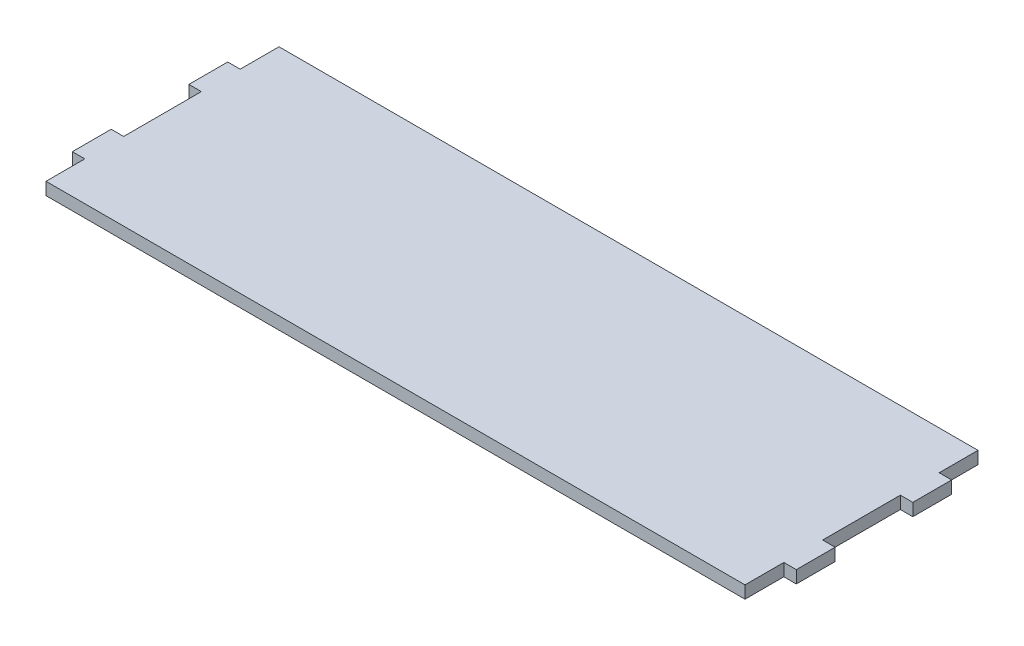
from build123d import *

# Parameters (mm, degrees)
BOSS_EXTRUDE1_DEPTH = 16.30000042


with BuildPart() as part:
    # Sketch1 → Boss-Extrude1 (new body)
    with BuildSketch(Plane(origin=(0, 0, 0), x_dir=(1, 0, 0), z_dir=(0, 1, 0))):
        Polygon((-59.371990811, 260.123418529), (855.028009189, 260.123418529), (855.028009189, 209.323418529), (871.328009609, 209.323418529), (871.328009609, 158.523418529), (855.028009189, 158.523418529), (855.028009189, 56.923418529), (871.328009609, 56.923418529), (871.328009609, 6.123418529), (855.028009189, 6.123418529), (855.028009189, -44.676581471), (-59.371990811, -44.676581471), (-59.371990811, 6.123418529), (-75.671991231, 6.123418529), (-75.671991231, 56.923418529), (-59.371990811, 56.923418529), (-59.371990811, 158.523418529), (-75.671991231, 158.523418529), (-75.671991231, 209.323418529), (-59.371990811, 209.323418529), align=None)
    extrude(amount=BOSS_EXTRUDE1_DEPTH)


solid = part.part
